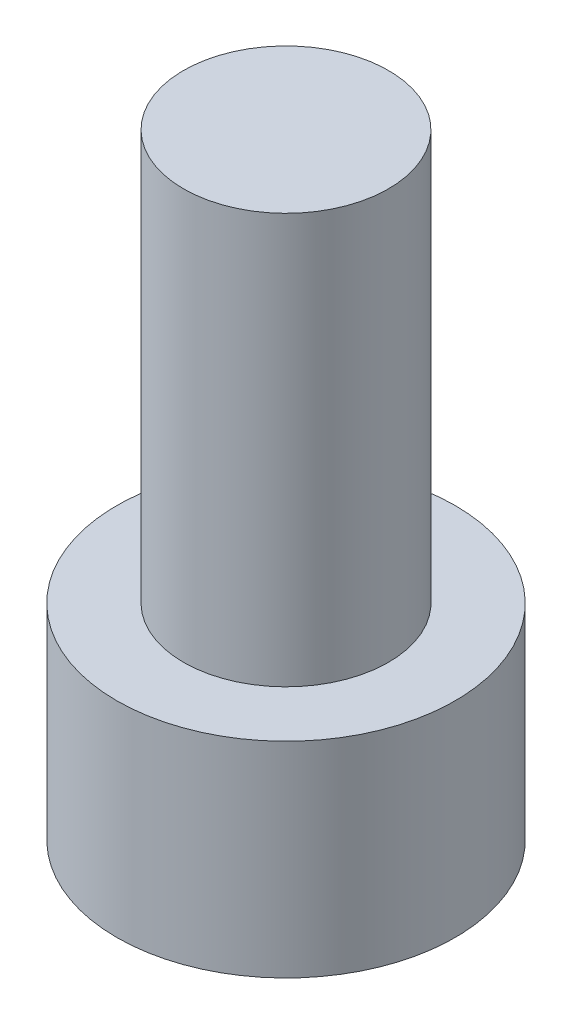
ISO-10303-21;
HEADER;
FILE_DESCRIPTION(('STEP AP214'),'2;1');
FILE_NAME('part.step','',(''),(''),'','','');
FILE_SCHEMA(('AUTOMOTIVE_DESIGN { 1 0 10303 214 1 1 1 1 }'));
ENDSEC;
DATA;
#1=APPLICATION_CONTEXT('core data for automotive mechanical design processes');
#2=APPLICATION_PROTOCOL_DEFINITION('international standard','automotive_design',2000,#1);
#3=PRODUCT_CONTEXT('',#1,'mechanical');
#4=PRODUCT('Part','Part','',(#3));
#5=PRODUCT_RELATED_PRODUCT_CATEGORY('part','',(#4));
#6=PRODUCT_DEFINITION_FORMATION('','',#4);
#7=PRODUCT_DEFINITION_CONTEXT('part definition',#1,'design');
#8=PRODUCT_DEFINITION('design','',#6,#7);
#9=PRODUCT_DEFINITION_SHAPE('','',#8);
#10=(LENGTH_UNIT() NAMED_UNIT(*) SI_UNIT(.MILLI.,.METRE.));
#11=(NAMED_UNIT(*) PLANE_ANGLE_UNIT() SI_UNIT($,.RADIAN.));
#12=(NAMED_UNIT(*) SI_UNIT($,.STERADIAN.) SOLID_ANGLE_UNIT());
#13=UNCERTAINTY_MEASURE_WITH_UNIT(LENGTH_MEASURE(1.E-05),#10,'distance_accuracy_value','');
#14=(GEOMETRIC_REPRESENTATION_CONTEXT(3) GLOBAL_UNCERTAINTY_ASSIGNED_CONTEXT((#13)) GLOBAL_UNIT_ASSIGNED_CONTEXT((#10,
#11,#12)) REPRESENTATION_CONTEXT('',''));
#15=CARTESIAN_POINT('',(0.,0.,0.));
#16=DIRECTION('',(0.,0.,1.));
#17=DIRECTION('',(1.,0.,0.));
#18=AXIS2_PLACEMENT_3D('',#15,#16,#17);
#19=CARTESIAN_POINT('',(0.,8.,0.));
#20=DIRECTION('',(0.,-1.,0.));
#21=DIRECTION('',(0.,0.,-1.));
#22=AXIS2_PLACEMENT_3D('',#19,#20,#21);
#23=CYLINDRICAL_SURFACE('',#22,6.6);
#24=CARTESIAN_POINT('',(0.,8.,0.));
#25=DIRECTION('',(0.,1.,0.));
#26=DIRECTION('',(0.,0.,1.));
#27=AXIS2_PLACEMENT_3D('',#24,#25,#26);
#28=CIRCLE('',#27,6.6);
#29=CARTESIAN_POINT('',(0.,8.,6.6));
#30=VERTEX_POINT('',#29);
#31=EDGE_CURVE('E51',#30,#30,#28,.T.);
#32=ORIENTED_EDGE('',*,*,#31,.F.);
#33=EDGE_LOOP('',(#32));
#34=FACE_BOUND('',#33,.T.);
#35=CARTESIAN_POINT('',(0.,0.,0.));
#36=DIRECTION('',(0.,1.,0.));
#37=DIRECTION('',(0.,0.,1.));
#38=AXIS2_PLACEMENT_3D('',#35,#36,#37);
#39=CIRCLE('',#38,6.6);
#40=CARTESIAN_POINT('',(0.,0.,6.6));
#41=VERTEX_POINT('',#40);
#42=EDGE_CURVE('E46',#41,#41,#39,.T.);
#43=ORIENTED_EDGE('',*,*,#42,.T.);
#44=EDGE_LOOP('',(#43));
#45=FACE_BOUND('',#44,.T.);
#46=ADVANCED_FACE('F43',(#34,#45),#23,.T.);
#47=CARTESIAN_POINT('',(0.,8.,0.));
#48=DIRECTION('',(0.,1.,0.));
#49=DIRECTION('',(0.,0.,1.));
#50=AXIS2_PLACEMENT_3D('',#47,#48,#49);
#51=PLANE('',#50);
#52=CARTESIAN_POINT('',(0.,8.,0.));
#53=DIRECTION('',(0.,1.,0.));
#54=DIRECTION('',(0.,0.,1.));
#55=AXIS2_PLACEMENT_3D('',#52,#53,#54);
#56=CIRCLE('',#55,4.);
#57=CARTESIAN_POINT('',(0.,8.,4.));
#58=VERTEX_POINT('',#57);
#59=EDGE_CURVE('E11',#58,#58,#56,.T.);
#60=ORIENTED_EDGE('',*,*,#59,.F.);
#61=EDGE_LOOP('',(#60));
#62=FACE_BOUND('',#61,.T.);
#63=ORIENTED_EDGE('',*,*,#31,.T.);
#64=EDGE_LOOP('',(#63));
#65=FACE_BOUND('',#64,.T.);
#66=ADVANCED_FACE('F161',(#62,#65),#51,.T.);
#67=CARTESIAN_POINT('',(0.,0.,0.));
#68=DIRECTION('',(0.,1.,0.));
#69=DIRECTION('',(0.,0.,1.));
#70=AXIS2_PLACEMENT_3D('',#67,#68,#69);
#71=PLANE('',#70);
#72=DIRECTION('',(0.103212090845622,0.,0.99465937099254));
#73=VECTOR('',#72,1.);
#74=CARTESIAN_POINT('',(2.80520952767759,0.,-2.03243683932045));
#75=LINE('',#74,#73);
#76=CARTESIAN_POINT('',(2.80520952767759,0.,-2.03243683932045));
#77=VERTEX_POINT('',#76);
#78=CARTESIAN_POINT('',(3.16274669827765,0.,1.41316429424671));
#79=VERTEX_POINT('',#78);
#80=EDGE_CURVE('E134',#77,#79,#75,.T.);
#81=ORIENTED_EDGE('',*,*,#80,.F.);
#82=DIRECTION('',(0.913006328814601,0.,0.407945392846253));
#83=VECTOR('',#82,1.);
#84=CARTESIAN_POINT('',(-0.357537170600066,0.,-3.44560113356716));
#85=LINE('',#84,#83);
#86=CARTESIAN_POINT('',(-0.357537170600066,0.,-3.44560113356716));
#87=VERTEX_POINT('',#86);
#88=EDGE_CURVE('E56',#87,#77,#85,.T.);
#89=ORIENTED_EDGE('',*,*,#88,.F.);
#90=DIRECTION('',(0.809794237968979,0.,-0.586713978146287));
#91=VECTOR('',#90,1.);
#92=CARTESIAN_POINT('',(-3.16274669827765,0.,-1.41316429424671));
#93=LINE('',#92,#91);
#94=CARTESIAN_POINT('',(-3.16274669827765,0.,-1.41316429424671));
#95=VERTEX_POINT('',#94);
#96=EDGE_CURVE('E145',#95,#87,#93,.T.);
#97=ORIENTED_EDGE('',*,*,#96,.F.);
#98=DIRECTION('',(-0.103212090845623,0.,-0.99465937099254));
#99=VECTOR('',#98,1.);
#100=CARTESIAN_POINT('',(-2.80520952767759,0.,2.03243683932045));
#101=LINE('',#100,#99);
#102=CARTESIAN_POINT('',(-2.80520952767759,0.,2.03243683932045));
#103=VERTEX_POINT('',#102);
#104=EDGE_CURVE('E140',#103,#95,#101,.T.);
#105=ORIENTED_EDGE('',*,*,#104,.F.);
#106=DIRECTION('',(-0.913006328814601,0.,-0.407945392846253));
#107=VECTOR('',#106,1.);
#108=CARTESIAN_POINT('',(0.357537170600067,0.,3.44560113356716));
#109=LINE('',#108,#107);
#110=CARTESIAN_POINT('',(0.357537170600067,0.,3.44560113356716));
#111=VERTEX_POINT('',#110);
#112=EDGE_CURVE('E110',#111,#103,#109,.T.);
#113=ORIENTED_EDGE('',*,*,#112,.F.);
#114=DIRECTION('',(-0.809794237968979,0.,0.586713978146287));
#115=VECTOR('',#114,1.);
#116=CARTESIAN_POINT('',(3.16274669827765,0.,1.41316429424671));
#117=LINE('',#116,#115);
#118=EDGE_CURVE('E136',#79,#111,#117,.T.);
#119=ORIENTED_EDGE('',*,*,#118,.F.);
#120=EDGE_LOOP('',(#81,#89,#97,#105,#113,#119));
#121=FACE_BOUND('',#120,.T.);
#122=ORIENTED_EDGE('',*,*,#42,.F.);
#123=EDGE_LOOP('',(#122));
#124=FACE_BOUND('',#123,.T.);
#125=ADVANCED_FACE('F160',(#121,#124),#71,.F.);
#126=CARTESIAN_POINT('',(0.,24.,0.));
#127=DIRECTION('',(0.,-1.,0.));
#128=DIRECTION('',(0.,0.,-1.));
#129=AXIS2_PLACEMENT_3D('',#126,#127,#128);
#130=CYLINDRICAL_SURFACE('',#129,4.);
#131=CARTESIAN_POINT('',(0.,24.,0.));
#132=DIRECTION('',(0.,1.,0.));
#133=DIRECTION('',(0.,0.,1.));
#134=AXIS2_PLACEMENT_3D('',#131,#132,#133);
#135=CIRCLE('',#134,4.);
#136=CARTESIAN_POINT('',(0.,24.,4.));
#137=VERTEX_POINT('',#136);
#138=EDGE_CURVE('E147',#137,#137,#135,.T.);
#139=ORIENTED_EDGE('',*,*,#138,.F.);
#140=EDGE_LOOP('',(#139));
#141=FACE_BOUND('',#140,.T.);
#142=ORIENTED_EDGE('',*,*,#59,.T.);
#143=EDGE_LOOP('',(#142));
#144=FACE_BOUND('',#143,.T.);
#145=ADVANCED_FACE('F162',(#141,#144),#130,.T.);
#146=CARTESIAN_POINT('',(0.,24.,0.));
#147=DIRECTION('',(0.,1.,0.));
#148=DIRECTION('',(0.,0.,1.));
#149=AXIS2_PLACEMENT_3D('',#146,#147,#148);
#150=PLANE('',#149);
#151=ORIENTED_EDGE('',*,*,#138,.T.);
#152=EDGE_LOOP('',(#151));
#153=FACE_BOUND('',#152,.T.);
#154=ADVANCED_FACE('F167',(#153),#150,.T.);
#155=CARTESIAN_POINT('',(-0.357537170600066,4.,-3.44560113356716));
#156=DIRECTION('',(0.407945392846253,0.,-0.913006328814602));
#157=DIRECTION('',(-0.913006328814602,0.,-0.407945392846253));
#158=AXIS2_PLACEMENT_3D('',#155,#156,#157);
#159=PLANE('',#158);
#160=ORIENTED_EDGE('',*,*,#88,.T.);
#161=DIRECTION('',(0.,-1.,0.));
#162=VECTOR('',#161,1.);
#163=CARTESIAN_POINT('',(2.80520952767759,4.,-2.03243683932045));
#164=LINE('',#163,#162);
#165=CARTESIAN_POINT('',(2.80520952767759,4.,-2.03243683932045));
#166=VERTEX_POINT('',#165);
#167=EDGE_CURVE('E86',#166,#77,#164,.T.);
#168=ORIENTED_EDGE('',*,*,#167,.F.);
#169=DIRECTION('',(0.913006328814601,0.,0.407945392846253));
#170=VECTOR('',#169,1.);
#171=CARTESIAN_POINT('',(-0.357537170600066,4.,-3.44560113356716));
#172=LINE('',#171,#170);
#173=CARTESIAN_POINT('',(-0.357537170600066,4.,-3.44560113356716));
#174=VERTEX_POINT('',#173);
#175=EDGE_CURVE('E144',#174,#166,#172,.T.);
#176=ORIENTED_EDGE('',*,*,#175,.F.);
#177=DIRECTION('',(0.,-1.,0.));
#178=VECTOR('',#177,1.);
#179=CARTESIAN_POINT('',(-0.357537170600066,4.,-3.44560113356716));
#180=LINE('',#179,#178);
#181=EDGE_CURVE('E70',#174,#87,#180,.T.);
#182=ORIENTED_EDGE('',*,*,#181,.T.);
#183=EDGE_LOOP('',(#160,#168,#176,#182));
#184=FACE_BOUND('',#183,.T.);
#185=ADVANCED_FACE('F199',(#184),#159,.F.);
#186=CARTESIAN_POINT('',(-3.16274669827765,4.,-1.41316429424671));
#187=DIRECTION('',(-0.586713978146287,0.,-0.809794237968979));
#188=DIRECTION('',(-0.809794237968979,0.,0.586713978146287));
#189=AXIS2_PLACEMENT_3D('',#186,#187,#188);
#190=PLANE('',#189);
#191=ORIENTED_EDGE('',*,*,#96,.T.);
#192=ORIENTED_EDGE('',*,*,#181,.F.);
#193=DIRECTION('',(0.809794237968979,0.,-0.586713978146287));
#194=VECTOR('',#193,1.);
#195=CARTESIAN_POINT('',(-3.16274669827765,4.,-1.41316429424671));
#196=LINE('',#195,#194);
#197=CARTESIAN_POINT('',(-3.16274669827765,4.,-1.41316429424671));
#198=VERTEX_POINT('',#197);
#199=EDGE_CURVE('E118',#198,#174,#196,.T.);
#200=ORIENTED_EDGE('',*,*,#199,.F.);
#201=DIRECTION('',(0.,-1.,0.));
#202=VECTOR('',#201,1.);
#203=CARTESIAN_POINT('',(-3.16274669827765,4.,-1.41316429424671));
#204=LINE('',#203,#202);
#205=EDGE_CURVE('E111',#198,#95,#204,.T.);
#206=ORIENTED_EDGE('',*,*,#205,.T.);
#207=EDGE_LOOP('',(#191,#192,#200,#206));
#208=FACE_BOUND('',#207,.T.);
#209=ADVANCED_FACE('F208',(#208),#190,.F.);
#210=CARTESIAN_POINT('',(-2.80520952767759,4.,2.03243683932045));
#211=DIRECTION('',(-0.99465937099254,0.,0.103212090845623));
#212=DIRECTION('',(0.103212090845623,0.,0.99465937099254));
#213=AXIS2_PLACEMENT_3D('',#210,#211,#212);
#214=PLANE('',#213);
#215=ORIENTED_EDGE('',*,*,#104,.T.);
#216=ORIENTED_EDGE('',*,*,#205,.F.);
#217=DIRECTION('',(-0.103212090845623,0.,-0.99465937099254));
#218=VECTOR('',#217,1.);
#219=CARTESIAN_POINT('',(-2.80520952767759,4.,2.03243683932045));
#220=LINE('',#219,#218);
#221=CARTESIAN_POINT('',(-2.80520952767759,4.,2.03243683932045));
#222=VERTEX_POINT('',#221);
#223=EDGE_CURVE('E114',#222,#198,#220,.T.);
#224=ORIENTED_EDGE('',*,*,#223,.F.);
#225=DIRECTION('',(0.,-1.,0.));
#226=VECTOR('',#225,1.);
#227=CARTESIAN_POINT('',(-2.80520952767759,4.,2.03243683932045));
#228=LINE('',#227,#226);
#229=EDGE_CURVE('E99',#222,#103,#228,.T.);
#230=ORIENTED_EDGE('',*,*,#229,.T.);
#231=EDGE_LOOP('',(#215,#216,#224,#230));
#232=FACE_BOUND('',#231,.T.);
#233=ADVANCED_FACE('F116',(#232),#214,.F.);
#234=CARTESIAN_POINT('',(0.357537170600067,4.,3.44560113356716));
#235=DIRECTION('',(-0.407945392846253,0.,0.913006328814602));
#236=DIRECTION('',(0.913006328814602,0.,0.407945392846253));
#237=AXIS2_PLACEMENT_3D('',#234,#235,#236);
#238=PLANE('',#237);
#239=ORIENTED_EDGE('',*,*,#112,.T.);
#240=ORIENTED_EDGE('',*,*,#229,.F.);
#241=DIRECTION('',(-0.913006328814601,0.,-0.407945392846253));
#242=VECTOR('',#241,1.);
#243=CARTESIAN_POINT('',(0.357537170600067,4.,3.44560113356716));
#244=LINE('',#243,#242);
#245=CARTESIAN_POINT('',(0.357537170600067,4.,3.44560113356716));
#246=VERTEX_POINT('',#245);
#247=EDGE_CURVE('E104',#246,#222,#244,.T.);
#248=ORIENTED_EDGE('',*,*,#247,.F.);
#249=DIRECTION('',(0.,-1.,0.));
#250=VECTOR('',#249,1.);
#251=CARTESIAN_POINT('',(0.357537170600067,4.,3.44560113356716));
#252=LINE('',#251,#250);
#253=EDGE_CURVE('E115',#246,#111,#252,.T.);
#254=ORIENTED_EDGE('',*,*,#253,.T.);
#255=EDGE_LOOP('',(#239,#240,#248,#254));
#256=FACE_BOUND('',#255,.T.);
#257=ADVANCED_FACE('F105',(#256),#238,.F.);
#258=CARTESIAN_POINT('',(3.16274669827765,4.,1.41316429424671));
#259=DIRECTION('',(0.586713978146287,0.,0.809794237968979));
#260=DIRECTION('',(0.809794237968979,0.,-0.586713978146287));
#261=AXIS2_PLACEMENT_3D('',#258,#259,#260);
#262=PLANE('',#261);
#263=ORIENTED_EDGE('',*,*,#118,.T.);
#264=ORIENTED_EDGE('',*,*,#253,.F.);
#265=DIRECTION('',(-0.809794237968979,0.,0.586713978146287));
#266=VECTOR('',#265,1.);
#267=CARTESIAN_POINT('',(3.16274669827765,4.,1.41316429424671));
#268=LINE('',#267,#266);
#269=CARTESIAN_POINT('',(3.16274669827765,4.,1.41316429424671));
#270=VERTEX_POINT('',#269);
#271=EDGE_CURVE('E123',#270,#246,#268,.T.);
#272=ORIENTED_EDGE('',*,*,#271,.F.);
#273=DIRECTION('',(0.,-1.,0.));
#274=VECTOR('',#273,1.);
#275=CARTESIAN_POINT('',(3.16274669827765,4.,1.41316429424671));
#276=LINE('',#275,#274);
#277=EDGE_CURVE('E146',#270,#79,#276,.T.);
#278=ORIENTED_EDGE('',*,*,#277,.T.);
#279=EDGE_LOOP('',(#263,#264,#272,#278));
#280=FACE_BOUND('',#279,.T.);
#281=ADVANCED_FACE('F232',(#280),#262,.F.);
#282=CARTESIAN_POINT('',(2.80520952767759,4.,-2.03243683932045));
#283=DIRECTION('',(0.99465937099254,0.,-0.103212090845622));
#284=DIRECTION('',(-0.103212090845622,0.,-0.99465937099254));
#285=AXIS2_PLACEMENT_3D('',#282,#283,#284);
#286=PLANE('',#285);
#287=ORIENTED_EDGE('',*,*,#80,.T.);
#288=ORIENTED_EDGE('',*,*,#277,.F.);
#289=DIRECTION('',(0.103212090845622,0.,0.99465937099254));
#290=VECTOR('',#289,1.);
#291=CARTESIAN_POINT('',(2.80520952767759,4.,-2.03243683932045));
#292=LINE('',#291,#290);
#293=EDGE_CURVE('E130',#166,#270,#292,.T.);
#294=ORIENTED_EDGE('',*,*,#293,.F.);
#295=ORIENTED_EDGE('',*,*,#167,.T.);
#296=EDGE_LOOP('',(#287,#288,#294,#295));
#297=FACE_BOUND('',#296,.T.);
#298=ADVANCED_FACE('F242',(#297),#286,.F.);
#299=CARTESIAN_POINT('',(0.,4.,0.));
#300=DIRECTION('',(0.,-1.,0.));
#301=DIRECTION('',(0.,0.,-1.));
#302=AXIS2_PLACEMENT_3D('',#299,#300,#301);
#303=PLANE('',#302);
#304=ORIENTED_EDGE('',*,*,#175,.T.);
#305=ORIENTED_EDGE('',*,*,#293,.T.);
#306=ORIENTED_EDGE('',*,*,#271,.T.);
#307=ORIENTED_EDGE('',*,*,#247,.T.);
#308=ORIENTED_EDGE('',*,*,#223,.T.);
#309=ORIENTED_EDGE('',*,*,#199,.T.);
#310=EDGE_LOOP('',(#304,#305,#306,#307,#308,#309));
#311=FACE_BOUND('',#310,.T.);
#312=ADVANCED_FACE('F125',(#311),#303,.T.);
#313=CLOSED_SHELL('',(#46,#66,#125,#145,#154,#185,#209,#233,#257,#281,#298,#312));
#314=MANIFOLD_SOLID_BREP('B2',#313);
#315=ADVANCED_BREP_SHAPE_REPRESENTATION('',(#18,#314),#14);
#316=SHAPE_DEFINITION_REPRESENTATION(#9,#315);
ENDSEC;
END-ISO-10303-21;
